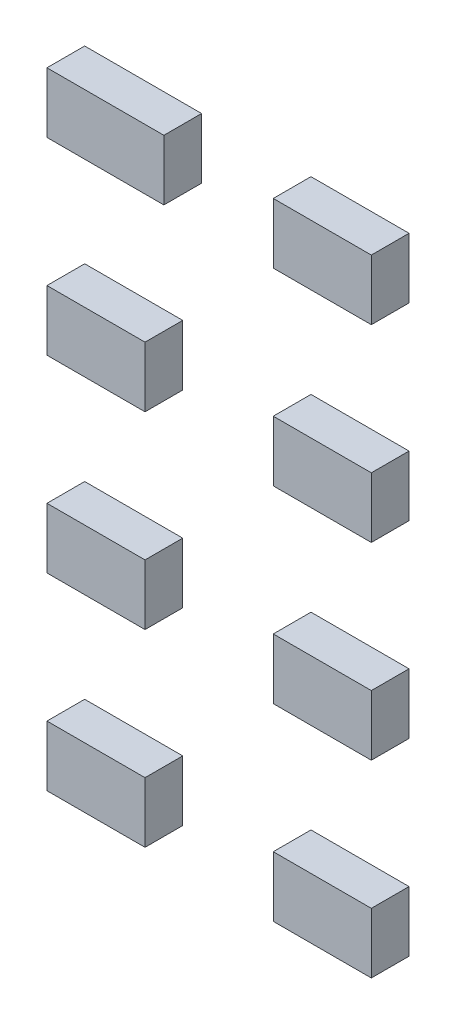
ISO-10303-21;
HEADER;
FILE_DESCRIPTION(('STEP AP214'),'2;1');
FILE_NAME('part.step','',(''),(''),'','','');
FILE_SCHEMA(('AUTOMOTIVE_DESIGN { 1 0 10303 214 1 1 1 1 }'));
ENDSEC;
DATA;
#1=APPLICATION_CONTEXT('core data for automotive mechanical design processes');
#2=APPLICATION_PROTOCOL_DEFINITION('international standard','automotive_design',2000,#1);
#3=PRODUCT_CONTEXT('',#1,'mechanical');
#4=PRODUCT('Part','Part','',(#3));
#5=PRODUCT_RELATED_PRODUCT_CATEGORY('part','',(#4));
#6=PRODUCT_DEFINITION_FORMATION('','',#4);
#7=PRODUCT_DEFINITION_CONTEXT('part definition',#1,'design');
#8=PRODUCT_DEFINITION('design','',#6,#7);
#9=PRODUCT_DEFINITION_SHAPE('','',#8);
#10=(LENGTH_UNIT() NAMED_UNIT(*) SI_UNIT(.MILLI.,.METRE.));
#11=(NAMED_UNIT(*) PLANE_ANGLE_UNIT() SI_UNIT($,.RADIAN.));
#12=(NAMED_UNIT(*) SI_UNIT($,.STERADIAN.) SOLID_ANGLE_UNIT());
#13=UNCERTAINTY_MEASURE_WITH_UNIT(LENGTH_MEASURE(1.E-05),#10,'distance_accuracy_value','');
#14=(GEOMETRIC_REPRESENTATION_CONTEXT(3) GLOBAL_UNCERTAINTY_ASSIGNED_CONTEXT((#13)) GLOBAL_UNIT_ASSIGNED_CONTEXT((#10,
#11,#12)) REPRESENTATION_CONTEXT('',''));
#15=CARTESIAN_POINT('',(0.,0.,0.));
#16=DIRECTION('',(0.,0.,1.));
#17=DIRECTION('',(1.,0.,0.));
#18=AXIS2_PLACEMENT_3D('',#15,#16,#17);
#19=CARTESIAN_POINT('',(-0.43,0.67,0.1));
#20=DIRECTION('',(0.,0.,1.));
#21=DIRECTION('',(1.,0.,0.));
#22=AXIS2_PLACEMENT_3D('',#19,#20,#21);
#23=PLANE('',#22);
#24=DIRECTION('',(0.,1.,0.));
#25=VECTOR('',#24,1.);
#26=CARTESIAN_POINT('',(-0.43,0.67,0.1));
#27=LINE('',#26,#25);
#28=CARTESIAN_POINT('',(-0.43,0.67,0.1));
#29=VERTEX_POINT('',#28);
#30=CARTESIAN_POINT('',(-0.43,0.83,0.1));
#31=VERTEX_POINT('',#30);
#32=EDGE_CURVE('P0_E108',#29,#31,#27,.T.);
#33=ORIENTED_EDGE('',*,*,#32,.F.);
#34=DIRECTION('',(1.,0.,0.));
#35=VECTOR('',#34,1.);
#36=CARTESIAN_POINT('',(-0.43,0.67,0.1));
#37=LINE('',#36,#35);
#38=CARTESIAN_POINT('',(-0.12,0.67,0.1));
#39=VERTEX_POINT('',#38);
#40=EDGE_CURVE('P0_E75',#29,#39,#37,.T.);
#41=ORIENTED_EDGE('',*,*,#40,.T.);
#42=DIRECTION('',(0.,1.,0.));
#43=VECTOR('',#42,1.);
#44=CARTESIAN_POINT('',(-0.12,0.67,0.1));
#45=LINE('',#44,#43);
#46=CARTESIAN_POINT('',(-0.12,0.83,0.1));
#47=VERTEX_POINT('',#46);
#48=EDGE_CURVE('P0_E87',#39,#47,#45,.T.);
#49=ORIENTED_EDGE('',*,*,#48,.T.);
#50=DIRECTION('',(1.,0.,0.));
#51=VECTOR('',#50,1.);
#52=CARTESIAN_POINT('',(-0.43,0.83,0.1));
#53=LINE('',#52,#51);
#54=EDGE_CURVE('P0_E11',#31,#47,#53,.T.);
#55=ORIENTED_EDGE('',*,*,#54,.F.);
#56=EDGE_LOOP('',(#33,#41,#49,#55));
#57=FACE_BOUND('',#56,.T.);
#58=ADVANCED_FACE('P0_F17',(#57),#23,.T.);
#59=CARTESIAN_POINT('',(-0.43,0.67,0.));
#60=DIRECTION('',(0.,0.,1.));
#61=DIRECTION('',(1.,0.,0.));
#62=AXIS2_PLACEMENT_3D('',#59,#60,#61);
#63=PLANE('',#62);
#64=DIRECTION('',(1.,0.,0.));
#65=VECTOR('',#64,1.);
#66=CARTESIAN_POINT('',(-0.43,0.83,0.));
#67=LINE('',#66,#65);
#68=CARTESIAN_POINT('',(-0.43,0.83,0.));
#69=VERTEX_POINT('',#68);
#70=CARTESIAN_POINT('',(-0.12,0.83,0.));
#71=VERTEX_POINT('',#70);
#72=EDGE_CURVE('P0_E25',#69,#71,#67,.T.);
#73=ORIENTED_EDGE('',*,*,#72,.T.);
#74=DIRECTION('',(0.,1.,0.));
#75=VECTOR('',#74,1.);
#76=CARTESIAN_POINT('',(-0.12,0.67,0.));
#77=LINE('',#76,#75);
#78=CARTESIAN_POINT('',(-0.12,0.67,0.));
#79=VERTEX_POINT('',#78);
#80=EDGE_CURVE('P0_E78',#79,#71,#77,.T.);
#81=ORIENTED_EDGE('',*,*,#80,.F.);
#82=DIRECTION('',(1.,0.,0.));
#83=VECTOR('',#82,1.);
#84=CARTESIAN_POINT('',(-0.43,0.67,0.));
#85=LINE('',#84,#83);
#86=CARTESIAN_POINT('',(-0.43,0.67,0.));
#87=VERTEX_POINT('',#86);
#88=EDGE_CURVE('P0_E66',#87,#79,#85,.T.);
#89=ORIENTED_EDGE('',*,*,#88,.F.);
#90=DIRECTION('',(0.,1.,0.));
#91=VECTOR('',#90,1.);
#92=CARTESIAN_POINT('',(-0.43,0.67,0.));
#93=LINE('',#92,#91);
#94=EDGE_CURVE('P0_E94',#87,#69,#93,.T.);
#95=ORIENTED_EDGE('',*,*,#94,.T.);
#96=EDGE_LOOP('',(#73,#81,#89,#95));
#97=FACE_BOUND('',#96,.T.);
#98=ADVANCED_FACE('P0_F79',(#97),#63,.F.);
#99=CARTESIAN_POINT('',(-0.43,0.83,0.));
#100=DIRECTION('',(0.,1.,0.));
#101=DIRECTION('',(1.,0.,0.));
#102=AXIS2_PLACEMENT_3D('',#99,#100,#101);
#103=PLANE('',#102);
#104=ORIENTED_EDGE('',*,*,#72,.F.);
#105=DIRECTION('',(0.,0.,1.));
#106=VECTOR('',#105,1.);
#107=CARTESIAN_POINT('',(-0.43,0.83,0.));
#108=LINE('',#107,#106);
#109=EDGE_CURVE('P0_E113',#69,#31,#108,.T.);
#110=ORIENTED_EDGE('',*,*,#109,.T.);
#111=ORIENTED_EDGE('',*,*,#54,.T.);
#112=DIRECTION('',(0.,0.,1.));
#113=VECTOR('',#112,1.);
#114=CARTESIAN_POINT('',(-0.12,0.83,0.));
#115=LINE('',#114,#113);
#116=EDGE_CURVE('P0_E83',#71,#47,#115,.T.);
#117=ORIENTED_EDGE('',*,*,#116,.F.);
#118=EDGE_LOOP('',(#104,#110,#111,#117));
#119=FACE_BOUND('',#118,.T.);
#120=ADVANCED_FACE('P0_F125',(#119),#103,.T.);
#121=CARTESIAN_POINT('',(-0.43,0.67,0.));
#122=DIRECTION('',(0.,1.,0.));
#123=DIRECTION('',(1.,0.,0.));
#124=AXIS2_PLACEMENT_3D('',#121,#122,#123);
#125=PLANE('',#124);
#126=DIRECTION('',(0.,0.,1.));
#127=VECTOR('',#126,1.);
#128=CARTESIAN_POINT('',(-0.12,0.67,0.));
#129=LINE('',#128,#127);
#130=EDGE_CURVE('P0_E70',#79,#39,#129,.T.);
#131=ORIENTED_EDGE('',*,*,#130,.T.);
#132=ORIENTED_EDGE('',*,*,#40,.F.);
#133=DIRECTION('',(0.,0.,1.));
#134=VECTOR('',#133,1.);
#135=CARTESIAN_POINT('',(-0.43,0.67,0.));
#136=LINE('',#135,#134);
#137=EDGE_CURVE('P0_E72',#87,#29,#136,.T.);
#138=ORIENTED_EDGE('',*,*,#137,.F.);
#139=ORIENTED_EDGE('',*,*,#88,.T.);
#140=EDGE_LOOP('',(#131,#132,#138,#139));
#141=FACE_BOUND('',#140,.T.);
#142=ADVANCED_FACE('P0_F67',(#141),#125,.F.);
#143=CARTESIAN_POINT('',(-0.12,0.67,0.));
#144=DIRECTION('',(1.,0.,0.));
#145=DIRECTION('',(0.,1.,0.));
#146=AXIS2_PLACEMENT_3D('',#143,#144,#145);
#147=PLANE('',#146);
#148=ORIENTED_EDGE('',*,*,#130,.F.);
#149=ORIENTED_EDGE('',*,*,#80,.T.);
#150=ORIENTED_EDGE('',*,*,#116,.T.);
#151=ORIENTED_EDGE('',*,*,#48,.F.);
#152=EDGE_LOOP('',(#148,#149,#150,#151));
#153=FACE_BOUND('',#152,.T.);
#154=ADVANCED_FACE('P0_F86',(#153),#147,.T.);
#155=CARTESIAN_POINT('',(-0.43,0.67,0.));
#156=DIRECTION('',(1.,0.,0.));
#157=DIRECTION('',(0.,1.,0.));
#158=AXIS2_PLACEMENT_3D('',#155,#156,#157);
#159=PLANE('',#158);
#160=ORIENTED_EDGE('',*,*,#32,.T.);
#161=ORIENTED_EDGE('',*,*,#109,.F.);
#162=ORIENTED_EDGE('',*,*,#94,.F.);
#163=ORIENTED_EDGE('',*,*,#137,.T.);
#164=EDGE_LOOP('',(#160,#161,#162,#163));
#165=FACE_BOUND('',#164,.T.);
#166=ADVANCED_FACE('P0_F111',(#165),#159,.F.);
#167=CLOSED_SHELL('',(#58,#98,#120,#142,#154,#166));
#168=MANIFOLD_SOLID_BREP('P0_B1',#167);
#169=CARTESIAN_POINT('',(-0.43,0.17,0.1));
#170=DIRECTION('',(0.,0.,1.));
#171=DIRECTION('',(1.,0.,0.));
#172=AXIS2_PLACEMENT_3D('',#169,#170,#171);
#173=PLANE('',#172);
#174=DIRECTION('',(0.,1.,0.));
#175=VECTOR('',#174,1.);
#176=CARTESIAN_POINT('',(-0.43,0.17,0.1));
#177=LINE('',#176,#175);
#178=CARTESIAN_POINT('',(-0.43,0.17,0.1));
#179=VERTEX_POINT('',#178);
#180=CARTESIAN_POINT('',(-0.43,0.33,0.1));
#181=VERTEX_POINT('',#180);
#182=EDGE_CURVE('P1_E88',#179,#181,#177,.T.);
#183=ORIENTED_EDGE('',*,*,#182,.F.);
#184=DIRECTION('',(1.,0.,0.));
#185=VECTOR('',#184,1.);
#186=CARTESIAN_POINT('',(-0.43,0.17,0.1));
#187=LINE('',#186,#185);
#188=CARTESIAN_POINT('',(-0.17,0.17,0.1));
#189=VERTEX_POINT('',#188);
#190=EDGE_CURVE('P1_E72',#179,#189,#187,.T.);
#191=ORIENTED_EDGE('',*,*,#190,.T.);
#192=DIRECTION('',(0.,1.,0.));
#193=VECTOR('',#192,1.);
#194=CARTESIAN_POINT('',(-0.17,0.17,0.1));
#195=LINE('',#194,#193);
#196=CARTESIAN_POINT('',(-0.17,0.33,0.1));
#197=VERTEX_POINT('',#196);
#198=EDGE_CURVE('P1_E83',#189,#197,#195,.T.);
#199=ORIENTED_EDGE('',*,*,#198,.T.);
#200=DIRECTION('',(1.,0.,0.));
#201=VECTOR('',#200,1.);
#202=CARTESIAN_POINT('',(-0.43,0.33,0.1));
#203=LINE('',#202,#201);
#204=EDGE_CURVE('P1_E11',#181,#197,#203,.T.);
#205=ORIENTED_EDGE('',*,*,#204,.F.);
#206=EDGE_LOOP('',(#183,#191,#199,#205));
#207=FACE_BOUND('',#206,.T.);
#208=ADVANCED_FACE('P1_F17',(#207),#173,.T.);
#209=CARTESIAN_POINT('',(-0.43,0.17,0.));
#210=DIRECTION('',(0.,0.,1.));
#211=DIRECTION('',(1.,0.,0.));
#212=AXIS2_PLACEMENT_3D('',#209,#210,#211);
#213=PLANE('',#212);
#214=DIRECTION('',(1.,0.,0.));
#215=VECTOR('',#214,1.);
#216=CARTESIAN_POINT('',(-0.43,0.33,0.));
#217=LINE('',#216,#215);
#218=CARTESIAN_POINT('',(-0.43,0.33,0.));
#219=VERTEX_POINT('',#218);
#220=CARTESIAN_POINT('',(-0.17,0.33,0.));
#221=VERTEX_POINT('',#220);
#222=EDGE_CURVE('P1_E26',#219,#221,#217,.T.);
#223=ORIENTED_EDGE('',*,*,#222,.T.);
#224=DIRECTION('',(0.,1.,0.));
#225=VECTOR('',#224,1.);
#226=CARTESIAN_POINT('',(-0.17,0.17,0.));
#227=LINE('',#226,#225);
#228=CARTESIAN_POINT('',(-0.17,0.17,0.));
#229=VERTEX_POINT('',#228);
#230=EDGE_CURVE('P1_E107',#229,#221,#227,.T.);
#231=ORIENTED_EDGE('',*,*,#230,.F.);
#232=DIRECTION('',(1.,0.,0.));
#233=VECTOR('',#232,1.);
#234=CARTESIAN_POINT('',(-0.43,0.17,0.));
#235=LINE('',#234,#233);
#236=CARTESIAN_POINT('',(-0.43,0.17,0.));
#237=VERTEX_POINT('',#236);
#238=EDGE_CURVE('P1_E20',#237,#229,#235,.T.);
#239=ORIENTED_EDGE('',*,*,#238,.F.);
#240=DIRECTION('',(0.,1.,0.));
#241=VECTOR('',#240,1.);
#242=CARTESIAN_POINT('',(-0.43,0.17,0.));
#243=LINE('',#242,#241);
#244=EDGE_CURVE('P1_E89',#237,#219,#243,.T.);
#245=ORIENTED_EDGE('',*,*,#244,.T.);
#246=EDGE_LOOP('',(#223,#231,#239,#245));
#247=FACE_BOUND('',#246,.T.);
#248=ADVANCED_FACE('P1_F121',(#247),#213,.F.);
#249=CARTESIAN_POINT('',(-0.43,0.33,0.));
#250=DIRECTION('',(0.,1.,0.));
#251=DIRECTION('',(1.,0.,0.));
#252=AXIS2_PLACEMENT_3D('',#249,#250,#251);
#253=PLANE('',#252);
#254=ORIENTED_EDGE('',*,*,#222,.F.);
#255=DIRECTION('',(0.,0.,1.));
#256=VECTOR('',#255,1.);
#257=CARTESIAN_POINT('',(-0.43,0.33,0.));
#258=LINE('',#257,#256);
#259=EDGE_CURVE('P1_E93',#219,#181,#258,.T.);
#260=ORIENTED_EDGE('',*,*,#259,.T.);
#261=ORIENTED_EDGE('',*,*,#204,.T.);
#262=DIRECTION('',(0.,0.,1.));
#263=VECTOR('',#262,1.);
#264=CARTESIAN_POINT('',(-0.17,0.33,0.));
#265=LINE('',#264,#263);
#266=EDGE_CURVE('P1_E111',#221,#197,#265,.T.);
#267=ORIENTED_EDGE('',*,*,#266,.F.);
#268=EDGE_LOOP('',(#254,#260,#261,#267));
#269=FACE_BOUND('',#268,.T.);
#270=ADVANCED_FACE('P1_F120',(#269),#253,.T.);
#271=CARTESIAN_POINT('',(-0.43,0.17,0.));
#272=DIRECTION('',(0.,1.,0.));
#273=DIRECTION('',(1.,0.,0.));
#274=AXIS2_PLACEMENT_3D('',#271,#272,#273);
#275=PLANE('',#274);
#276=DIRECTION('',(0.,0.,1.));
#277=VECTOR('',#276,1.);
#278=CARTESIAN_POINT('',(-0.17,0.17,0.));
#279=LINE('',#278,#277);
#280=EDGE_CURVE('P1_E78',#229,#189,#279,.T.);
#281=ORIENTED_EDGE('',*,*,#280,.T.);
#282=ORIENTED_EDGE('',*,*,#190,.F.);
#283=DIRECTION('',(0.,0.,1.));
#284=VECTOR('',#283,1.);
#285=CARTESIAN_POINT('',(-0.43,0.17,0.));
#286=LINE('',#285,#284);
#287=EDGE_CURVE('P1_E75',#237,#179,#286,.T.);
#288=ORIENTED_EDGE('',*,*,#287,.F.);
#289=ORIENTED_EDGE('',*,*,#238,.T.);
#290=EDGE_LOOP('',(#281,#282,#288,#289));
#291=FACE_BOUND('',#290,.T.);
#292=ADVANCED_FACE('P1_F74',(#291),#275,.F.);
#293=CARTESIAN_POINT('',(-0.17,0.17,0.));
#294=DIRECTION('',(1.,0.,0.));
#295=DIRECTION('',(0.,1.,0.));
#296=AXIS2_PLACEMENT_3D('',#293,#294,#295);
#297=PLANE('',#296);
#298=ORIENTED_EDGE('',*,*,#280,.F.);
#299=ORIENTED_EDGE('',*,*,#230,.T.);
#300=ORIENTED_EDGE('',*,*,#266,.T.);
#301=ORIENTED_EDGE('',*,*,#198,.F.);
#302=EDGE_LOOP('',(#298,#299,#300,#301));
#303=FACE_BOUND('',#302,.T.);
#304=ADVANCED_FACE('P1_F119',(#303),#297,.T.);
#305=CARTESIAN_POINT('',(-0.43,0.17,0.));
#306=DIRECTION('',(1.,0.,0.));
#307=DIRECTION('',(0.,1.,0.));
#308=AXIS2_PLACEMENT_3D('',#305,#306,#307);
#309=PLANE('',#308);
#310=ORIENTED_EDGE('',*,*,#182,.T.);
#311=ORIENTED_EDGE('',*,*,#259,.F.);
#312=ORIENTED_EDGE('',*,*,#244,.F.);
#313=ORIENTED_EDGE('',*,*,#287,.T.);
#314=EDGE_LOOP('',(#310,#311,#312,#313));
#315=FACE_BOUND('',#314,.T.);
#316=ADVANCED_FACE('P1_F86',(#315),#309,.F.);
#317=CLOSED_SHELL('',(#208,#248,#270,#292,#304,#316));
#318=MANIFOLD_SOLID_BREP('P1_B1',#317);
#319=CARTESIAN_POINT('',(-0.43,-0.33,0.1));
#320=DIRECTION('',(0.,0.,1.));
#321=DIRECTION('',(1.,0.,0.));
#322=AXIS2_PLACEMENT_3D('',#319,#320,#321);
#323=PLANE('',#322);
#324=DIRECTION('',(0.,1.,0.));
#325=VECTOR('',#324,1.);
#326=CARTESIAN_POINT('',(-0.43,-0.33,0.1));
#327=LINE('',#326,#325);
#328=CARTESIAN_POINT('',(-0.43,-0.33,0.1));
#329=VERTEX_POINT('',#328);
#330=CARTESIAN_POINT('',(-0.43,-0.17,0.1));
#331=VERTEX_POINT('',#330);
#332=EDGE_CURVE('P2_E88',#329,#331,#327,.T.);
#333=ORIENTED_EDGE('',*,*,#332,.F.);
#334=DIRECTION('',(1.,0.,0.));
#335=VECTOR('',#334,1.);
#336=CARTESIAN_POINT('',(-0.43,-0.33,0.1));
#337=LINE('',#336,#335);
#338=CARTESIAN_POINT('',(-0.17,-0.33,0.1));
#339=VERTEX_POINT('',#338);
#340=EDGE_CURVE('P2_E70',#329,#339,#337,.T.);
#341=ORIENTED_EDGE('',*,*,#340,.T.);
#342=DIRECTION('',(0.,1.,0.));
#343=VECTOR('',#342,1.);
#344=CARTESIAN_POINT('',(-0.17,-0.33,0.1));
#345=LINE('',#344,#343);
#346=CARTESIAN_POINT('',(-0.17,-0.17,0.1));
#347=VERTEX_POINT('',#346);
#348=EDGE_CURVE('P2_E82',#339,#347,#345,.T.);
#349=ORIENTED_EDGE('',*,*,#348,.T.);
#350=DIRECTION('',(1.,0.,0.));
#351=VECTOR('',#350,1.);
#352=CARTESIAN_POINT('',(-0.43,-0.17,0.1));
#353=LINE('',#352,#351);
#354=EDGE_CURVE('P2_E11',#331,#347,#353,.T.);
#355=ORIENTED_EDGE('',*,*,#354,.F.);
#356=EDGE_LOOP('',(#333,#341,#349,#355));
#357=FACE_BOUND('',#356,.T.);
#358=ADVANCED_FACE('P2_F17',(#357),#323,.T.);
#359=CARTESIAN_POINT('',(-0.43,-0.33,0.));
#360=DIRECTION('',(0.,0.,1.));
#361=DIRECTION('',(1.,0.,0.));
#362=AXIS2_PLACEMENT_3D('',#359,#360,#361);
#363=PLANE('',#362);
#364=DIRECTION('',(1.,0.,0.));
#365=VECTOR('',#364,1.);
#366=CARTESIAN_POINT('',(-0.43,-0.17,0.));
#367=LINE('',#366,#365);
#368=CARTESIAN_POINT('',(-0.43,-0.17,0.));
#369=VERTEX_POINT('',#368);
#370=CARTESIAN_POINT('',(-0.17,-0.17,0.));
#371=VERTEX_POINT('',#370);
#372=EDGE_CURVE('P2_E25',#369,#371,#367,.T.);
#373=ORIENTED_EDGE('',*,*,#372,.T.);
#374=DIRECTION('',(0.,1.,0.));
#375=VECTOR('',#374,1.);
#376=CARTESIAN_POINT('',(-0.17,-0.33,0.));
#377=LINE('',#376,#375);
#378=CARTESIAN_POINT('',(-0.17,-0.33,0.));
#379=VERTEX_POINT('',#378);
#380=EDGE_CURVE('P2_E101',#379,#371,#377,.T.);
#381=ORIENTED_EDGE('',*,*,#380,.F.);
#382=DIRECTION('',(1.,0.,0.));
#383=VECTOR('',#382,1.);
#384=CARTESIAN_POINT('',(-0.43,-0.33,0.));
#385=LINE('',#384,#383);
#386=CARTESIAN_POINT('',(-0.43,-0.33,0.));
#387=VERTEX_POINT('',#386);
#388=EDGE_CURVE('P2_E81',#387,#379,#385,.T.);
#389=ORIENTED_EDGE('',*,*,#388,.F.);
#390=DIRECTION('',(0.,1.,0.));
#391=VECTOR('',#390,1.);
#392=CARTESIAN_POINT('',(-0.43,-0.33,0.));
#393=LINE('',#392,#391);
#394=EDGE_CURVE('P2_E89',#387,#369,#393,.T.);
#395=ORIENTED_EDGE('',*,*,#394,.T.);
#396=EDGE_LOOP('',(#373,#381,#389,#395));
#397=FACE_BOUND('',#396,.T.);
#398=ADVANCED_FACE('P2_F156',(#397),#363,.F.);
#399=CARTESIAN_POINT('',(-0.43,-0.17,0.));
#400=DIRECTION('',(0.,1.,0.));
#401=DIRECTION('',(1.,0.,0.));
#402=AXIS2_PLACEMENT_3D('',#399,#400,#401);
#403=PLANE('',#402);
#404=ORIENTED_EDGE('',*,*,#372,.F.);
#405=DIRECTION('',(0.,0.,1.));
#406=VECTOR('',#405,1.);
#407=CARTESIAN_POINT('',(-0.43,-0.17,0.));
#408=LINE('',#407,#406);
#409=EDGE_CURVE('P2_E93',#369,#331,#408,.T.);
#410=ORIENTED_EDGE('',*,*,#409,.T.);
#411=ORIENTED_EDGE('',*,*,#354,.T.);
#412=DIRECTION('',(0.,0.,1.));
#413=VECTOR('',#412,1.);
#414=CARTESIAN_POINT('',(-0.17,-0.17,0.));
#415=LINE('',#414,#413);
#416=EDGE_CURVE('P2_E105',#371,#347,#415,.T.);
#417=ORIENTED_EDGE('',*,*,#416,.F.);
#418=EDGE_LOOP('',(#404,#410,#411,#417));
#419=FACE_BOUND('',#418,.T.);
#420=ADVANCED_FACE('P2_F157',(#419),#403,.T.);
#421=CARTESIAN_POINT('',(-0.43,-0.33,0.));
#422=DIRECTION('',(0.,1.,0.));
#423=DIRECTION('',(1.,0.,0.));
#424=AXIS2_PLACEMENT_3D('',#421,#422,#423);
#425=PLANE('',#424);
#426=DIRECTION('',(0.,0.,1.));
#427=VECTOR('',#426,1.);
#428=CARTESIAN_POINT('',(-0.17,-0.33,0.));
#429=LINE('',#428,#427);
#430=EDGE_CURVE('P2_E76',#379,#339,#429,.T.);
#431=ORIENTED_EDGE('',*,*,#430,.T.);
#432=ORIENTED_EDGE('',*,*,#340,.F.);
#433=DIRECTION('',(0.,0.,1.));
#434=VECTOR('',#433,1.);
#435=CARTESIAN_POINT('',(-0.43,-0.33,0.));
#436=LINE('',#435,#434);
#437=EDGE_CURVE('P2_E73',#387,#329,#436,.T.);
#438=ORIENTED_EDGE('',*,*,#437,.F.);
#439=ORIENTED_EDGE('',*,*,#388,.T.);
#440=EDGE_LOOP('',(#431,#432,#438,#439));
#441=FACE_BOUND('',#440,.T.);
#442=ADVANCED_FACE('P2_F72',(#441),#425,.F.);
#443=CARTESIAN_POINT('',(-0.17,-0.33,0.));
#444=DIRECTION('',(1.,0.,0.));
#445=DIRECTION('',(0.,1.,0.));
#446=AXIS2_PLACEMENT_3D('',#443,#444,#445);
#447=PLANE('',#446);
#448=ORIENTED_EDGE('',*,*,#430,.F.);
#449=ORIENTED_EDGE('',*,*,#380,.T.);
#450=ORIENTED_EDGE('',*,*,#416,.T.);
#451=ORIENTED_EDGE('',*,*,#348,.F.);
#452=EDGE_LOOP('',(#448,#449,#450,#451));
#453=FACE_BOUND('',#452,.T.);
#454=ADVANCED_FACE('P2_F155',(#453),#447,.T.);
#455=CARTESIAN_POINT('',(-0.43,-0.33,0.));
#456=DIRECTION('',(1.,0.,0.));
#457=DIRECTION('',(0.,1.,0.));
#458=AXIS2_PLACEMENT_3D('',#455,#456,#457);
#459=PLANE('',#458);
#460=ORIENTED_EDGE('',*,*,#332,.T.);
#461=ORIENTED_EDGE('',*,*,#409,.F.);
#462=ORIENTED_EDGE('',*,*,#394,.F.);
#463=ORIENTED_EDGE('',*,*,#437,.T.);
#464=EDGE_LOOP('',(#460,#461,#462,#463));
#465=FACE_BOUND('',#464,.T.);
#466=ADVANCED_FACE('P2_F86',(#465),#459,.F.);
#467=CLOSED_SHELL('',(#358,#398,#420,#442,#454,#466));
#468=MANIFOLD_SOLID_BREP('P2_B1',#467);
#469=CARTESIAN_POINT('',(-0.43,-0.83,0.1));
#470=DIRECTION('',(0.,0.,1.));
#471=DIRECTION('',(1.,0.,0.));
#472=AXIS2_PLACEMENT_3D('',#469,#470,#471);
#473=PLANE('',#472);
#474=DIRECTION('',(0.,1.,0.));
#475=VECTOR('',#474,1.);
#476=CARTESIAN_POINT('',(-0.43,-0.83,0.1));
#477=LINE('',#476,#475);
#478=CARTESIAN_POINT('',(-0.43,-0.83,0.1));
#479=VERTEX_POINT('',#478);
#480=CARTESIAN_POINT('',(-0.43,-0.67,0.1));
#481=VERTEX_POINT('',#480);
#482=EDGE_CURVE('P3_E88',#479,#481,#477,.T.);
#483=ORIENTED_EDGE('',*,*,#482,.F.);
#484=DIRECTION('',(1.,0.,0.));
#485=VECTOR('',#484,1.);
#486=CARTESIAN_POINT('',(-0.43,-0.83,0.1));
#487=LINE('',#486,#485);
#488=CARTESIAN_POINT('',(-0.17,-0.83,0.1));
#489=VERTEX_POINT('',#488);
#490=EDGE_CURVE('P3_E70',#479,#489,#487,.T.);
#491=ORIENTED_EDGE('',*,*,#490,.T.);
#492=DIRECTION('',(0.,1.,0.));
#493=VECTOR('',#492,1.);
#494=CARTESIAN_POINT('',(-0.17,-0.83,0.1));
#495=LINE('',#494,#493);
#496=CARTESIAN_POINT('',(-0.17,-0.67,0.1));
#497=VERTEX_POINT('',#496);
#498=EDGE_CURVE('P3_E82',#489,#497,#495,.T.);
#499=ORIENTED_EDGE('',*,*,#498,.T.);
#500=DIRECTION('',(1.,0.,0.));
#501=VECTOR('',#500,1.);
#502=CARTESIAN_POINT('',(-0.43,-0.67,0.1));
#503=LINE('',#502,#501);
#504=EDGE_CURVE('P3_E11',#481,#497,#503,.T.);
#505=ORIENTED_EDGE('',*,*,#504,.F.);
#506=EDGE_LOOP('',(#483,#491,#499,#505));
#507=FACE_BOUND('',#506,.T.);
#508=ADVANCED_FACE('P3_F17',(#507),#473,.T.);
#509=CARTESIAN_POINT('',(-0.43,-0.83,0.));
#510=DIRECTION('',(0.,0.,1.));
#511=DIRECTION('',(1.,0.,0.));
#512=AXIS2_PLACEMENT_3D('',#509,#510,#511);
#513=PLANE('',#512);
#514=DIRECTION('',(1.,0.,0.));
#515=VECTOR('',#514,1.);
#516=CARTESIAN_POINT('',(-0.43,-0.67,0.));
#517=LINE('',#516,#515);
#518=CARTESIAN_POINT('',(-0.43,-0.67,0.));
#519=VERTEX_POINT('',#518);
#520=CARTESIAN_POINT('',(-0.17,-0.67,0.));
#521=VERTEX_POINT('',#520);
#522=EDGE_CURVE('P3_E25',#519,#521,#517,.T.);
#523=ORIENTED_EDGE('',*,*,#522,.T.);
#524=DIRECTION('',(0.,1.,0.));
#525=VECTOR('',#524,1.);
#526=CARTESIAN_POINT('',(-0.17,-0.83,0.));
#527=LINE('',#526,#525);
#528=CARTESIAN_POINT('',(-0.17,-0.83,0.));
#529=VERTEX_POINT('',#528);
#530=EDGE_CURVE('P3_E107',#529,#521,#527,.T.);
#531=ORIENTED_EDGE('',*,*,#530,.F.);
#532=DIRECTION('',(1.,0.,0.));
#533=VECTOR('',#532,1.);
#534=CARTESIAN_POINT('',(-0.43,-0.83,0.));
#535=LINE('',#534,#533);
#536=CARTESIAN_POINT('',(-0.43,-0.83,0.));
#537=VERTEX_POINT('',#536);
#538=EDGE_CURVE('P3_E81',#537,#529,#535,.T.);
#539=ORIENTED_EDGE('',*,*,#538,.F.);
#540=DIRECTION('',(0.,1.,0.));
#541=VECTOR('',#540,1.);
#542=CARTESIAN_POINT('',(-0.43,-0.83,0.));
#543=LINE('',#542,#541);
#544=EDGE_CURVE('P3_E89',#537,#519,#543,.T.);
#545=ORIENTED_EDGE('',*,*,#544,.T.);
#546=EDGE_LOOP('',(#523,#531,#539,#545));
#547=FACE_BOUND('',#546,.T.);
#548=ADVANCED_FACE('P3_F119',(#547),#513,.F.);
#549=CARTESIAN_POINT('',(-0.43,-0.67,0.));
#550=DIRECTION('',(0.,1.,0.));
#551=DIRECTION('',(1.,0.,0.));
#552=AXIS2_PLACEMENT_3D('',#549,#550,#551);
#553=PLANE('',#552);
#554=ORIENTED_EDGE('',*,*,#522,.F.);
#555=DIRECTION('',(0.,0.,1.));
#556=VECTOR('',#555,1.);
#557=CARTESIAN_POINT('',(-0.43,-0.67,0.));
#558=LINE('',#557,#556);
#559=EDGE_CURVE('P3_E93',#519,#481,#558,.T.);
#560=ORIENTED_EDGE('',*,*,#559,.T.);
#561=ORIENTED_EDGE('',*,*,#504,.T.);
#562=DIRECTION('',(0.,0.,1.));
#563=VECTOR('',#562,1.);
#564=CARTESIAN_POINT('',(-0.17,-0.67,0.));
#565=LINE('',#564,#563);
#566=EDGE_CURVE('P3_E111',#521,#497,#565,.T.);
#567=ORIENTED_EDGE('',*,*,#566,.F.);
#568=EDGE_LOOP('',(#554,#560,#561,#567));
#569=FACE_BOUND('',#568,.T.);
#570=ADVANCED_FACE('P3_F122',(#569),#553,.T.);
#571=CARTESIAN_POINT('',(-0.43,-0.83,0.));
#572=DIRECTION('',(0.,1.,0.));
#573=DIRECTION('',(1.,0.,0.));
#574=AXIS2_PLACEMENT_3D('',#571,#572,#573);
#575=PLANE('',#574);
#576=DIRECTION('',(0.,0.,1.));
#577=VECTOR('',#576,1.);
#578=CARTESIAN_POINT('',(-0.17,-0.83,0.));
#579=LINE('',#578,#577);
#580=EDGE_CURVE('P3_E76',#529,#489,#579,.T.);
#581=ORIENTED_EDGE('',*,*,#580,.T.);
#582=ORIENTED_EDGE('',*,*,#490,.F.);
#583=DIRECTION('',(0.,0.,1.));
#584=VECTOR('',#583,1.);
#585=CARTESIAN_POINT('',(-0.43,-0.83,0.));
#586=LINE('',#585,#584);
#587=EDGE_CURVE('P3_E73',#537,#479,#586,.T.);
#588=ORIENTED_EDGE('',*,*,#587,.F.);
#589=ORIENTED_EDGE('',*,*,#538,.T.);
#590=EDGE_LOOP('',(#581,#582,#588,#589));
#591=FACE_BOUND('',#590,.T.);
#592=ADVANCED_FACE('P3_F72',(#591),#575,.F.);
#593=CARTESIAN_POINT('',(-0.17,-0.83,0.));
#594=DIRECTION('',(1.,0.,0.));
#595=DIRECTION('',(0.,1.,0.));
#596=AXIS2_PLACEMENT_3D('',#593,#594,#595);
#597=PLANE('',#596);
#598=ORIENTED_EDGE('',*,*,#580,.F.);
#599=ORIENTED_EDGE('',*,*,#530,.T.);
#600=ORIENTED_EDGE('',*,*,#566,.T.);
#601=ORIENTED_EDGE('',*,*,#498,.F.);
#602=EDGE_LOOP('',(#598,#599,#600,#601));
#603=FACE_BOUND('',#602,.T.);
#604=ADVANCED_FACE('P3_F121',(#603),#597,.T.);
#605=CARTESIAN_POINT('',(-0.43,-0.83,0.));
#606=DIRECTION('',(1.,0.,0.));
#607=DIRECTION('',(0.,1.,0.));
#608=AXIS2_PLACEMENT_3D('',#605,#606,#607);
#609=PLANE('',#608);
#610=ORIENTED_EDGE('',*,*,#482,.T.);
#611=ORIENTED_EDGE('',*,*,#559,.F.);
#612=ORIENTED_EDGE('',*,*,#544,.F.);
#613=ORIENTED_EDGE('',*,*,#587,.T.);
#614=EDGE_LOOP('',(#610,#611,#612,#613));
#615=FACE_BOUND('',#614,.T.);
#616=ADVANCED_FACE('P3_F86',(#615),#609,.F.);
#617=CLOSED_SHELL('',(#508,#548,#570,#592,#604,#616));
#618=MANIFOLD_SOLID_BREP('P3_B1',#617);
#619=CARTESIAN_POINT('',(0.17,-0.83,0.1));
#620=DIRECTION('',(0.,0.,1.));
#621=DIRECTION('',(1.,0.,0.));
#622=AXIS2_PLACEMENT_3D('',#619,#620,#621);
#623=PLANE('',#622);
#624=DIRECTION('',(0.,1.,0.));
#625=VECTOR('',#624,1.);
#626=CARTESIAN_POINT('',(0.17,-0.83,0.1));
#627=LINE('',#626,#625);
#628=CARTESIAN_POINT('',(0.17,-0.83,0.1));
#629=VERTEX_POINT('',#628);
#630=CARTESIAN_POINT('',(0.17,-0.67,0.1));
#631=VERTEX_POINT('',#630);
#632=EDGE_CURVE('P4_E67',#629,#631,#627,.T.);
#633=ORIENTED_EDGE('',*,*,#632,.F.);
#634=DIRECTION('',(1.,0.,0.));
#635=VECTOR('',#634,1.);
#636=CARTESIAN_POINT('',(0.17,-0.83,0.1));
#637=LINE('',#636,#635);
#638=CARTESIAN_POINT('',(0.43,-0.83,0.1));
#639=VERTEX_POINT('',#638);
#640=EDGE_CURVE('P4_E62',#629,#639,#637,.T.);
#641=ORIENTED_EDGE('',*,*,#640,.T.);
#642=DIRECTION('',(0.,1.,0.));
#643=VECTOR('',#642,1.);
#644=CARTESIAN_POINT('',(0.43,-0.83,0.1));
#645=LINE('',#644,#643);
#646=CARTESIAN_POINT('',(0.43,-0.67,0.1));
#647=VERTEX_POINT('',#646);
#648=EDGE_CURVE('P4_E64',#639,#647,#645,.T.);
#649=ORIENTED_EDGE('',*,*,#648,.T.);
#650=DIRECTION('',(1.,0.,0.));
#651=VECTOR('',#650,1.);
#652=CARTESIAN_POINT('',(0.17,-0.67,0.1));
#653=LINE('',#652,#651);
#654=EDGE_CURVE('P4_E11',#631,#647,#653,.T.);
#655=ORIENTED_EDGE('',*,*,#654,.F.);
#656=EDGE_LOOP('',(#633,#641,#649,#655));
#657=FACE_BOUND('',#656,.T.);
#658=ADVANCED_FACE('P4_F17',(#657),#623,.T.);
#659=CARTESIAN_POINT('',(0.17,-0.83,0.));
#660=DIRECTION('',(0.,0.,1.));
#661=DIRECTION('',(1.,0.,0.));
#662=AXIS2_PLACEMENT_3D('',#659,#660,#661);
#663=PLANE('',#662);
#664=DIRECTION('',(1.,0.,0.));
#665=VECTOR('',#664,1.);
#666=CARTESIAN_POINT('',(0.17,-0.67,0.));
#667=LINE('',#666,#665);
#668=CARTESIAN_POINT('',(0.17,-0.67,0.));
#669=VERTEX_POINT('',#668);
#670=CARTESIAN_POINT('',(0.43,-0.67,0.));
#671=VERTEX_POINT('',#670);
#672=EDGE_CURVE('P4_E26',#669,#671,#667,.T.);
#673=ORIENTED_EDGE('',*,*,#672,.T.);
#674=DIRECTION('',(0.,1.,0.));
#675=VECTOR('',#674,1.);
#676=CARTESIAN_POINT('',(0.43,-0.83,0.));
#677=LINE('',#676,#675);
#678=CARTESIAN_POINT('',(0.43,-0.83,0.));
#679=VERTEX_POINT('',#678);
#680=EDGE_CURVE('P4_E86',#679,#671,#677,.T.);
#681=ORIENTED_EDGE('',*,*,#680,.F.);
#682=DIRECTION('',(1.,0.,0.));
#683=VECTOR('',#682,1.);
#684=CARTESIAN_POINT('',(0.17,-0.83,0.));
#685=LINE('',#684,#683);
#686=CARTESIAN_POINT('',(0.17,-0.83,0.));
#687=VERTEX_POINT('',#686);
#688=EDGE_CURVE('P4_E73',#687,#679,#685,.T.);
#689=ORIENTED_EDGE('',*,*,#688,.F.);
#690=DIRECTION('',(0.,1.,0.));
#691=VECTOR('',#690,1.);
#692=CARTESIAN_POINT('',(0.17,-0.83,0.));
#693=LINE('',#692,#691);
#694=EDGE_CURVE('P4_E95',#687,#669,#693,.T.);
#695=ORIENTED_EDGE('',*,*,#694,.T.);
#696=EDGE_LOOP('',(#673,#681,#689,#695));
#697=FACE_BOUND('',#696,.T.);
#698=ADVANCED_FACE('P4_F107',(#697),#663,.F.);
#699=CARTESIAN_POINT('',(0.17,-0.67,0.));
#700=DIRECTION('',(0.,1.,0.));
#701=DIRECTION('',(1.,0.,0.));
#702=AXIS2_PLACEMENT_3D('',#699,#700,#701);
#703=PLANE('',#702);
#704=ORIENTED_EDGE('',*,*,#672,.F.);
#705=DIRECTION('',(0.,0.,1.));
#706=VECTOR('',#705,1.);
#707=CARTESIAN_POINT('',(0.17,-0.67,0.));
#708=LINE('',#707,#706);
#709=EDGE_CURVE('P4_E166',#669,#631,#708,.T.);
#710=ORIENTED_EDGE('',*,*,#709,.T.);
#711=ORIENTED_EDGE('',*,*,#654,.T.);
#712=DIRECTION('',(0.,0.,1.));
#713=VECTOR('',#712,1.);
#714=CARTESIAN_POINT('',(0.43,-0.67,0.));
#715=LINE('',#714,#713);
#716=EDGE_CURVE('P4_E80',#671,#647,#715,.T.);
#717=ORIENTED_EDGE('',*,*,#716,.F.);
#718=EDGE_LOOP('',(#704,#710,#711,#717));
#719=FACE_BOUND('',#718,.T.);
#720=ADVANCED_FACE('P4_F110',(#719),#703,.T.);
#721=CARTESIAN_POINT('',(0.17,-0.83,0.));
#722=DIRECTION('',(0.,1.,0.));
#723=DIRECTION('',(1.,0.,0.));
#724=AXIS2_PLACEMENT_3D('',#721,#722,#723);
#725=PLANE('',#724);
#726=DIRECTION('',(0.,0.,1.));
#727=VECTOR('',#726,1.);
#728=CARTESIAN_POINT('',(0.43,-0.83,0.));
#729=LINE('',#728,#727);
#730=EDGE_CURVE('P4_E79',#679,#639,#729,.T.);
#731=ORIENTED_EDGE('',*,*,#730,.T.);
#732=ORIENTED_EDGE('',*,*,#640,.F.);
#733=DIRECTION('',(0.,0.,1.));
#734=VECTOR('',#733,1.);
#735=CARTESIAN_POINT('',(0.17,-0.83,0.));
#736=LINE('',#735,#734);
#737=EDGE_CURVE('P4_E87',#687,#629,#736,.T.);
#738=ORIENTED_EDGE('',*,*,#737,.F.);
#739=ORIENTED_EDGE('',*,*,#688,.T.);
#740=EDGE_LOOP('',(#731,#732,#738,#739));
#741=FACE_BOUND('',#740,.T.);
#742=ADVANCED_FACE('P4_F83',(#741),#725,.F.);
#743=CARTESIAN_POINT('',(0.43,-0.83,0.));
#744=DIRECTION('',(1.,0.,0.));
#745=DIRECTION('',(0.,1.,0.));
#746=AXIS2_PLACEMENT_3D('',#743,#744,#745);
#747=PLANE('',#746);
#748=ORIENTED_EDGE('',*,*,#730,.F.);
#749=ORIENTED_EDGE('',*,*,#680,.T.);
#750=ORIENTED_EDGE('',*,*,#716,.T.);
#751=ORIENTED_EDGE('',*,*,#648,.F.);
#752=EDGE_LOOP('',(#748,#749,#750,#751));
#753=FACE_BOUND('',#752,.T.);
#754=ADVANCED_FACE('P4_F77',(#753),#747,.T.);
#755=CARTESIAN_POINT('',(0.17,-0.83,0.));
#756=DIRECTION('',(1.,0.,0.));
#757=DIRECTION('',(0.,1.,0.));
#758=AXIS2_PLACEMENT_3D('',#755,#756,#757);
#759=PLANE('',#758);
#760=ORIENTED_EDGE('',*,*,#632,.T.);
#761=ORIENTED_EDGE('',*,*,#709,.F.);
#762=ORIENTED_EDGE('',*,*,#694,.F.);
#763=ORIENTED_EDGE('',*,*,#737,.T.);
#764=EDGE_LOOP('',(#760,#761,#762,#763));
#765=FACE_BOUND('',#764,.T.);
#766=ADVANCED_FACE('P4_F170',(#765),#759,.F.);
#767=CLOSED_SHELL('',(#658,#698,#720,#742,#754,#766));
#768=MANIFOLD_SOLID_BREP('P4_B1',#767);
#769=CARTESIAN_POINT('',(0.17,-0.33,0.1));
#770=DIRECTION('',(0.,0.,1.));
#771=DIRECTION('',(1.,0.,0.));
#772=AXIS2_PLACEMENT_3D('',#769,#770,#771);
#773=PLANE('',#772);
#774=DIRECTION('',(0.,1.,0.));
#775=VECTOR('',#774,1.);
#776=CARTESIAN_POINT('',(0.17,-0.33,0.1));
#777=LINE('',#776,#775);
#778=CARTESIAN_POINT('',(0.17,-0.33,0.1));
#779=VERTEX_POINT('',#778);
#780=CARTESIAN_POINT('',(0.17,-0.17,0.1));
#781=VERTEX_POINT('',#780);
#782=EDGE_CURVE('P5_E89',#779,#781,#777,.T.);
#783=ORIENTED_EDGE('',*,*,#782,.F.);
#784=DIRECTION('',(1.,0.,0.));
#785=VECTOR('',#784,1.);
#786=CARTESIAN_POINT('',(0.17,-0.33,0.1));
#787=LINE('',#786,#785);
#788=CARTESIAN_POINT('',(0.43,-0.33,0.1));
#789=VERTEX_POINT('',#788);
#790=EDGE_CURVE('P5_E71',#779,#789,#787,.T.);
#791=ORIENTED_EDGE('',*,*,#790,.T.);
#792=DIRECTION('',(0.,1.,0.));
#793=VECTOR('',#792,1.);
#794=CARTESIAN_POINT('',(0.43,-0.33,0.1));
#795=LINE('',#794,#793);
#796=CARTESIAN_POINT('',(0.43,-0.17,0.1));
#797=VERTEX_POINT('',#796);
#798=EDGE_CURVE('P5_E83',#789,#797,#795,.T.);
#799=ORIENTED_EDGE('',*,*,#798,.T.);
#800=DIRECTION('',(1.,0.,0.));
#801=VECTOR('',#800,1.);
#802=CARTESIAN_POINT('',(0.17,-0.17,0.1));
#803=LINE('',#802,#801);
#804=EDGE_CURVE('P5_E11',#781,#797,#803,.T.);
#805=ORIENTED_EDGE('',*,*,#804,.F.);
#806=EDGE_LOOP('',(#783,#791,#799,#805));
#807=FACE_BOUND('',#806,.T.);
#808=ADVANCED_FACE('P5_F17',(#807),#773,.T.);
#809=CARTESIAN_POINT('',(0.17,-0.33,0.));
#810=DIRECTION('',(0.,0.,1.));
#811=DIRECTION('',(1.,0.,0.));
#812=AXIS2_PLACEMENT_3D('',#809,#810,#811);
#813=PLANE('',#812);
#814=DIRECTION('',(1.,0.,0.));
#815=VECTOR('',#814,1.);
#816=CARTESIAN_POINT('',(0.17,-0.17,0.));
#817=LINE('',#816,#815);
#818=CARTESIAN_POINT('',(0.17,-0.17,0.));
#819=VERTEX_POINT('',#818);
#820=CARTESIAN_POINT('',(0.43,-0.17,0.));
#821=VERTEX_POINT('',#820);
#822=EDGE_CURVE('P5_E26',#819,#821,#817,.T.);
#823=ORIENTED_EDGE('',*,*,#822,.T.);
#824=DIRECTION('',(0.,1.,0.));
#825=VECTOR('',#824,1.);
#826=CARTESIAN_POINT('',(0.43,-0.33,0.));
#827=LINE('',#826,#825);
#828=CARTESIAN_POINT('',(0.43,-0.33,0.));
#829=VERTEX_POINT('',#828);
#830=EDGE_CURVE('P5_E108',#829,#821,#827,.T.);
#831=ORIENTED_EDGE('',*,*,#830,.F.);
#832=DIRECTION('',(1.,0.,0.));
#833=VECTOR('',#832,1.);
#834=CARTESIAN_POINT('',(0.17,-0.33,0.));
#835=LINE('',#834,#833);
#836=CARTESIAN_POINT('',(0.17,-0.33,0.));
#837=VERTEX_POINT('',#836);
#838=EDGE_CURVE('P5_E82',#837,#829,#835,.T.);
#839=ORIENTED_EDGE('',*,*,#838,.F.);
#840=DIRECTION('',(0.,1.,0.));
#841=VECTOR('',#840,1.);
#842=CARTESIAN_POINT('',(0.17,-0.33,0.));
#843=LINE('',#842,#841);
#844=EDGE_CURVE('P5_E90',#837,#819,#843,.T.);
#845=ORIENTED_EDGE('',*,*,#844,.T.);
#846=EDGE_LOOP('',(#823,#831,#839,#845));
#847=FACE_BOUND('',#846,.T.);
#848=ADVANCED_FACE('P5_F19',(#847),#813,.F.);
#849=CARTESIAN_POINT('',(0.17,-0.17,0.));
#850=DIRECTION('',(0.,1.,0.));
#851=DIRECTION('',(1.,0.,0.));
#852=AXIS2_PLACEMENT_3D('',#849,#850,#851);
#853=PLANE('',#852);
#854=ORIENTED_EDGE('',*,*,#822,.F.);
#855=DIRECTION('',(0.,0.,1.));
#856=VECTOR('',#855,1.);
#857=CARTESIAN_POINT('',(0.17,-0.17,0.));
#858=LINE('',#857,#856);
#859=EDGE_CURVE('P5_E94',#819,#781,#858,.T.);
#860=ORIENTED_EDGE('',*,*,#859,.T.);
#861=ORIENTED_EDGE('',*,*,#804,.T.);
#862=DIRECTION('',(0.,0.,1.));
#863=VECTOR('',#862,1.);
#864=CARTESIAN_POINT('',(0.43,-0.17,0.));
#865=LINE('',#864,#863);
#866=EDGE_CURVE('P5_E104',#821,#797,#865,.T.);
#867=ORIENTED_EDGE('',*,*,#866,.F.);
#868=EDGE_LOOP('',(#854,#860,#861,#867));
#869=FACE_BOUND('',#868,.T.);
#870=ADVANCED_FACE('P5_F180',(#869),#853,.T.);
#871=CARTESIAN_POINT('',(0.17,-0.33,0.));
#872=DIRECTION('',(0.,1.,0.));
#873=DIRECTION('',(1.,0.,0.));
#874=AXIS2_PLACEMENT_3D('',#871,#872,#873);
#875=PLANE('',#874);
#876=DIRECTION('',(0.,0.,1.));
#877=VECTOR('',#876,1.);
#878=CARTESIAN_POINT('',(0.43,-0.33,0.));
#879=LINE('',#878,#877);
#880=EDGE_CURVE('P5_E77',#829,#789,#879,.T.);
#881=ORIENTED_EDGE('',*,*,#880,.T.);
#882=ORIENTED_EDGE('',*,*,#790,.F.);
#883=DIRECTION('',(0.,0.,1.));
#884=VECTOR('',#883,1.);
#885=CARTESIAN_POINT('',(0.17,-0.33,0.));
#886=LINE('',#885,#884);
#887=EDGE_CURVE('P5_E74',#837,#779,#886,.T.);
#888=ORIENTED_EDGE('',*,*,#887,.F.);
#889=ORIENTED_EDGE('',*,*,#838,.T.);
#890=EDGE_LOOP('',(#881,#882,#888,#889));
#891=FACE_BOUND('',#890,.T.);
#892=ADVANCED_FACE('P5_F73',(#891),#875,.F.);
#893=CARTESIAN_POINT('',(0.43,-0.33,0.));
#894=DIRECTION('',(1.,0.,0.));
#895=DIRECTION('',(0.,1.,0.));
#896=AXIS2_PLACEMENT_3D('',#893,#894,#895);
#897=PLANE('',#896);
#898=ORIENTED_EDGE('',*,*,#880,.F.);
#899=ORIENTED_EDGE('',*,*,#830,.T.);
#900=ORIENTED_EDGE('',*,*,#866,.T.);
#901=ORIENTED_EDGE('',*,*,#798,.F.);
#902=EDGE_LOOP('',(#898,#899,#900,#901));
#903=FACE_BOUND('',#902,.T.);
#904=ADVANCED_FACE('P5_F161',(#903),#897,.T.);
#905=CARTESIAN_POINT('',(0.17,-0.33,0.));
#906=DIRECTION('',(1.,0.,0.));
#907=DIRECTION('',(0.,1.,0.));
#908=AXIS2_PLACEMENT_3D('',#905,#906,#907);
#909=PLANE('',#908);
#910=ORIENTED_EDGE('',*,*,#782,.T.);
#911=ORIENTED_EDGE('',*,*,#859,.F.);
#912=ORIENTED_EDGE('',*,*,#844,.F.);
#913=ORIENTED_EDGE('',*,*,#887,.T.);
#914=EDGE_LOOP('',(#910,#911,#912,#913));
#915=FACE_BOUND('',#914,.T.);
#916=ADVANCED_FACE('P5_F87',(#915),#909,.F.);
#917=CLOSED_SHELL('',(#808,#848,#870,#892,#904,#916));
#918=MANIFOLD_SOLID_BREP('P5_B1',#917);
#919=CARTESIAN_POINT('',(0.17,0.17,0.1));
#920=DIRECTION('',(0.,0.,1.));
#921=DIRECTION('',(1.,0.,0.));
#922=AXIS2_PLACEMENT_3D('',#919,#920,#921);
#923=PLANE('',#922);
#924=DIRECTION('',(0.,1.,0.));
#925=VECTOR('',#924,1.);
#926=CARTESIAN_POINT('',(0.17,0.17,0.1));
#927=LINE('',#926,#925);
#928=CARTESIAN_POINT('',(0.17,0.17,0.1));
#929=VERTEX_POINT('',#928);
#930=CARTESIAN_POINT('',(0.17,0.33,0.1));
#931=VERTEX_POINT('',#930);
#932=EDGE_CURVE('P6_E89',#929,#931,#927,.T.);
#933=ORIENTED_EDGE('',*,*,#932,.F.);
#934=DIRECTION('',(1.,0.,0.));
#935=VECTOR('',#934,1.);
#936=CARTESIAN_POINT('',(0.17,0.17,0.1));
#937=LINE('',#936,#935);
#938=CARTESIAN_POINT('',(0.43,0.17,0.1));
#939=VERTEX_POINT('',#938);
#940=EDGE_CURVE('P6_E71',#929,#939,#937,.T.);
#941=ORIENTED_EDGE('',*,*,#940,.T.);
#942=DIRECTION('',(0.,1.,0.));
#943=VECTOR('',#942,1.);
#944=CARTESIAN_POINT('',(0.43,0.17,0.1));
#945=LINE('',#944,#943);
#946=CARTESIAN_POINT('',(0.43,0.33,0.1));
#947=VERTEX_POINT('',#946);
#948=EDGE_CURVE('P6_E83',#939,#947,#945,.T.);
#949=ORIENTED_EDGE('',*,*,#948,.T.);
#950=DIRECTION('',(1.,0.,0.));
#951=VECTOR('',#950,1.);
#952=CARTESIAN_POINT('',(0.17,0.33,0.1));
#953=LINE('',#952,#951);
#954=EDGE_CURVE('P6_E11',#931,#947,#953,.T.);
#955=ORIENTED_EDGE('',*,*,#954,.F.);
#956=EDGE_LOOP('',(#933,#941,#949,#955));
#957=FACE_BOUND('',#956,.T.);
#958=ADVANCED_FACE('P6_F17',(#957),#923,.T.);
#959=CARTESIAN_POINT('',(0.17,0.17,0.));
#960=DIRECTION('',(0.,0.,1.));
#961=DIRECTION('',(1.,0.,0.));
#962=AXIS2_PLACEMENT_3D('',#959,#960,#961);
#963=PLANE('',#962);
#964=DIRECTION('',(1.,0.,0.));
#965=VECTOR('',#964,1.);
#966=CARTESIAN_POINT('',(0.17,0.33,0.));
#967=LINE('',#966,#965);
#968=CARTESIAN_POINT('',(0.17,0.33,0.));
#969=VERTEX_POINT('',#968);
#970=CARTESIAN_POINT('',(0.43,0.33,0.));
#971=VERTEX_POINT('',#970);
#972=EDGE_CURVE('P6_E20',#969,#971,#967,.T.);
#973=ORIENTED_EDGE('',*,*,#972,.T.);
#974=DIRECTION('',(0.,1.,0.));
#975=VECTOR('',#974,1.);
#976=CARTESIAN_POINT('',(0.43,0.17,0.));
#977=LINE('',#976,#975);
#978=CARTESIAN_POINT('',(0.43,0.17,0.));
#979=VERTEX_POINT('',#978);
#980=EDGE_CURVE('P6_E103',#979,#971,#977,.T.);
#981=ORIENTED_EDGE('',*,*,#980,.F.);
#982=DIRECTION('',(1.,0.,0.));
#983=VECTOR('',#982,1.);
#984=CARTESIAN_POINT('',(0.17,0.17,0.));
#985=LINE('',#984,#983);
#986=CARTESIAN_POINT('',(0.17,0.17,0.));
#987=VERTEX_POINT('',#986);
#988=EDGE_CURVE('P6_E82',#987,#979,#985,.T.);
#989=ORIENTED_EDGE('',*,*,#988,.F.);
#990=DIRECTION('',(0.,1.,0.));
#991=VECTOR('',#990,1.);
#992=CARTESIAN_POINT('',(0.17,0.17,0.));
#993=LINE('',#992,#991);
#994=EDGE_CURVE('P6_E90',#987,#969,#993,.T.);
#995=ORIENTED_EDGE('',*,*,#994,.T.);
#996=EDGE_LOOP('',(#973,#981,#989,#995));
#997=FACE_BOUND('',#996,.T.);
#998=ADVANCED_FACE('P6_F162',(#997),#963,.F.);
#999=CARTESIAN_POINT('',(0.17,0.33,0.));
#1000=DIRECTION('',(0.,1.,0.));
#1001=DIRECTION('',(1.,0.,0.));
#1002=AXIS2_PLACEMENT_3D('',#999,#1000,#1001);
#1003=PLANE('',#1002);
#1004=ORIENTED_EDGE('',*,*,#972,.F.);
#1005=DIRECTION('',(0.,0.,1.));
#1006=VECTOR('',#1005,1.);
#1007=CARTESIAN_POINT('',(0.17,0.33,0.));
#1008=LINE('',#1007,#1006);
#1009=EDGE_CURVE('P6_E94',#969,#931,#1008,.T.);
#1010=ORIENTED_EDGE('',*,*,#1009,.T.);
#1011=ORIENTED_EDGE('',*,*,#954,.T.);
#1012=DIRECTION('',(0.,0.,1.));
#1013=VECTOR('',#1012,1.);
#1014=CARTESIAN_POINT('',(0.43,0.33,0.));
#1015=LINE('',#1014,#1013);
#1016=EDGE_CURVE('P6_E106',#971,#947,#1015,.T.);
#1017=ORIENTED_EDGE('',*,*,#1016,.F.);
#1018=EDGE_LOOP('',(#1004,#1010,#1011,#1017));
#1019=FACE_BOUND('',#1018,.T.);
#1020=ADVANCED_FACE('P6_F153',(#1019),#1003,.T.);
#1021=CARTESIAN_POINT('',(0.17,0.17,0.));
#1022=DIRECTION('',(0.,1.,0.));
#1023=DIRECTION('',(1.,0.,0.));
#1024=AXIS2_PLACEMENT_3D('',#1021,#1022,#1023);
#1025=PLANE('',#1024);
#1026=DIRECTION('',(0.,0.,1.));
#1027=VECTOR('',#1026,1.);
#1028=CARTESIAN_POINT('',(0.43,0.17,0.));
#1029=LINE('',#1028,#1027);
#1030=EDGE_CURVE('P6_E77',#979,#939,#1029,.T.);
#1031=ORIENTED_EDGE('',*,*,#1030,.T.);
#1032=ORIENTED_EDGE('',*,*,#940,.F.);
#1033=DIRECTION('',(0.,0.,1.));
#1034=VECTOR('',#1033,1.);
#1035=CARTESIAN_POINT('',(0.17,0.17,0.));
#1036=LINE('',#1035,#1034);
#1037=EDGE_CURVE('P6_E74',#987,#929,#1036,.T.);
#1038=ORIENTED_EDGE('',*,*,#1037,.F.);
#1039=ORIENTED_EDGE('',*,*,#988,.T.);
#1040=EDGE_LOOP('',(#1031,#1032,#1038,#1039));
#1041=FACE_BOUND('',#1040,.T.);
#1042=ADVANCED_FACE('P6_F73',(#1041),#1025,.F.);
#1043=CARTESIAN_POINT('',(0.43,0.17,0.));
#1044=DIRECTION('',(1.,0.,0.));
#1045=DIRECTION('',(0.,1.,0.));
#1046=AXIS2_PLACEMENT_3D('',#1043,#1044,#1045);
#1047=PLANE('',#1046);
#1048=ORIENTED_EDGE('',*,*,#1030,.F.);
#1049=ORIENTED_EDGE('',*,*,#980,.T.);
#1050=ORIENTED_EDGE('',*,*,#1016,.T.);
#1051=ORIENTED_EDGE('',*,*,#948,.F.);
#1052=EDGE_LOOP('',(#1048,#1049,#1050,#1051));
#1053=FACE_BOUND('',#1052,.T.);
#1054=ADVANCED_FACE('P6_F133',(#1053),#1047,.T.);
#1055=CARTESIAN_POINT('',(0.17,0.17,0.));
#1056=DIRECTION('',(1.,0.,0.));
#1057=DIRECTION('',(0.,1.,0.));
#1058=AXIS2_PLACEMENT_3D('',#1055,#1056,#1057);
#1059=PLANE('',#1058);
#1060=ORIENTED_EDGE('',*,*,#932,.T.);
#1061=ORIENTED_EDGE('',*,*,#1009,.F.);
#1062=ORIENTED_EDGE('',*,*,#994,.F.);
#1063=ORIENTED_EDGE('',*,*,#1037,.T.);
#1064=EDGE_LOOP('',(#1060,#1061,#1062,#1063));
#1065=FACE_BOUND('',#1064,.T.);
#1066=ADVANCED_FACE('P6_F87',(#1065),#1059,.F.);
#1067=CLOSED_SHELL('',(#958,#998,#1020,#1042,#1054,#1066));
#1068=MANIFOLD_SOLID_BREP('P6_B1',#1067);
#1069=CARTESIAN_POINT('',(0.17,0.67,0.1));
#1070=DIRECTION('',(0.,0.,1.));
#1071=DIRECTION('',(1.,0.,0.));
#1072=AXIS2_PLACEMENT_3D('',#1069,#1070,#1071);
#1073=PLANE('',#1072);
#1074=DIRECTION('',(0.,1.,0.));
#1075=VECTOR('',#1074,1.);
#1076=CARTESIAN_POINT('',(0.17,0.67,0.1));
#1077=LINE('',#1076,#1075);
#1078=CARTESIAN_POINT('',(0.17,0.67,0.1));
#1079=VERTEX_POINT('',#1078);
#1080=CARTESIAN_POINT('',(0.17,0.83,0.1));
#1081=VERTEX_POINT('',#1080);
#1082=EDGE_CURVE('P7_E117',#1079,#1081,#1077,.T.);
#1083=ORIENTED_EDGE('',*,*,#1082,.F.);
#1084=DIRECTION('',(1.,0.,0.));
#1085=VECTOR('',#1084,1.);
#1086=CARTESIAN_POINT('',(0.17,0.67,0.1));
#1087=LINE('',#1086,#1085);
#1088=CARTESIAN_POINT('',(0.43,0.67,0.1));
#1089=VERTEX_POINT('',#1088);
#1090=EDGE_CURVE('P7_E78',#1079,#1089,#1087,.T.);
#1091=ORIENTED_EDGE('',*,*,#1090,.T.);
#1092=DIRECTION('',(0.,1.,0.));
#1093=VECTOR('',#1092,1.);
#1094=CARTESIAN_POINT('',(0.43,0.67,0.1));
#1095=LINE('',#1094,#1093);
#1096=CARTESIAN_POINT('',(0.43,0.83,0.1));
#1097=VERTEX_POINT('',#1096);
#1098=EDGE_CURVE('P7_E90',#1089,#1097,#1095,.T.);
#1099=ORIENTED_EDGE('',*,*,#1098,.T.);
#1100=DIRECTION('',(1.,0.,0.));
#1101=VECTOR('',#1100,1.);
#1102=CARTESIAN_POINT('',(0.17,0.83,0.1));
#1103=LINE('',#1102,#1101);
#1104=EDGE_CURVE('P7_E11',#1081,#1097,#1103,.T.);
#1105=ORIENTED_EDGE('',*,*,#1104,.F.);
#1106=EDGE_LOOP('',(#1083,#1091,#1099,#1105));
#1107=FACE_BOUND('',#1106,.T.);
#1108=ADVANCED_FACE('P7_F17',(#1107),#1073,.T.);
#1109=CARTESIAN_POINT('',(0.17,0.67,0.));
#1110=DIRECTION('',(0.,0.,1.));
#1111=DIRECTION('',(1.,0.,0.));
#1112=AXIS2_PLACEMENT_3D('',#1109,#1110,#1111);
#1113=PLANE('',#1112);
#1114=DIRECTION('',(1.,0.,0.));
#1115=VECTOR('',#1114,1.);
#1116=CARTESIAN_POINT('',(0.17,0.83,0.));
#1117=LINE('',#1116,#1115);
#1118=CARTESIAN_POINT('',(0.17,0.83,0.));
#1119=VERTEX_POINT('',#1118);
#1120=CARTESIAN_POINT('',(0.43,0.83,0.));
#1121=VERTEX_POINT('',#1120);
#1122=EDGE_CURVE('P7_E20',#1119,#1121,#1117,.T.);
#1123=ORIENTED_EDGE('',*,*,#1122,.T.);
#1124=DIRECTION('',(0.,1.,0.));
#1125=VECTOR('',#1124,1.);
#1126=CARTESIAN_POINT('',(0.43,0.67,0.));
#1127=LINE('',#1126,#1125);
#1128=CARTESIAN_POINT('',(0.43,0.67,0.));
#1129=VERTEX_POINT('',#1128);
#1130=EDGE_CURVE('P7_E81',#1129,#1121,#1127,.T.);
#1131=ORIENTED_EDGE('',*,*,#1130,.F.);
#1132=DIRECTION('',(1.,0.,0.));
#1133=VECTOR('',#1132,1.);
#1134=CARTESIAN_POINT('',(0.17,0.67,0.));
#1135=LINE('',#1134,#1133);
#1136=CARTESIAN_POINT('',(0.17,0.67,0.));
#1137=VERTEX_POINT('',#1136);
#1138=EDGE_CURVE('P7_E70',#1137,#1129,#1135,.T.);
#1139=ORIENTED_EDGE('',*,*,#1138,.F.);
#1140=DIRECTION('',(0.,1.,0.));
#1141=VECTOR('',#1140,1.);
#1142=CARTESIAN_POINT('',(0.17,0.67,0.));
#1143=LINE('',#1142,#1141);
#1144=EDGE_CURVE('P7_E97',#1137,#1119,#1143,.T.);
#1145=ORIENTED_EDGE('',*,*,#1144,.T.);
#1146=EDGE_LOOP('',(#1123,#1131,#1139,#1145));
#1147=FACE_BOUND('',#1146,.T.);
#1148=ADVANCED_FACE('P7_F82',(#1147),#1113,.F.);
#1149=CARTESIAN_POINT('',(0.17,0.83,0.));
#1150=DIRECTION('',(0.,1.,0.));
#1151=DIRECTION('',(1.,0.,0.));
#1152=AXIS2_PLACEMENT_3D('',#1149,#1150,#1151);
#1153=PLANE('',#1152);
#1154=ORIENTED_EDGE('',*,*,#1122,.F.);
#1155=DIRECTION('',(0.,0.,1.));
#1156=VECTOR('',#1155,1.);
#1157=CARTESIAN_POINT('',(0.17,0.83,0.));
#1158=LINE('',#1157,#1156);
#1159=EDGE_CURVE('P7_E116',#1119,#1081,#1158,.T.);
#1160=ORIENTED_EDGE('',*,*,#1159,.T.);
#1161=ORIENTED_EDGE('',*,*,#1104,.T.);
#1162=DIRECTION('',(0.,0.,1.));
#1163=VECTOR('',#1162,1.);
#1164=CARTESIAN_POINT('',(0.43,0.83,0.));
#1165=LINE('',#1164,#1163);
#1166=EDGE_CURVE('P7_E86',#1121,#1097,#1165,.T.);
#1167=ORIENTED_EDGE('',*,*,#1166,.F.);
#1168=EDGE_LOOP('',(#1154,#1160,#1161,#1167));
#1169=FACE_BOUND('',#1168,.T.);
#1170=ADVANCED_FACE('P7_F125',(#1169),#1153,.T.);
#1171=CARTESIAN_POINT('',(0.17,0.67,0.));
#1172=DIRECTION('',(0.,1.,0.));
#1173=DIRECTION('',(1.,0.,0.));
#1174=AXIS2_PLACEMENT_3D('',#1171,#1172,#1173);
#1175=PLANE('',#1174);
#1176=DIRECTION('',(0.,0.,1.));
#1177=VECTOR('',#1176,1.);
#1178=CARTESIAN_POINT('',(0.43,0.67,0.));
#1179=LINE('',#1178,#1177);
#1180=EDGE_CURVE('P7_E73',#1129,#1089,#1179,.T.);
#1181=ORIENTED_EDGE('',*,*,#1180,.T.);
#1182=ORIENTED_EDGE('',*,*,#1090,.F.);
#1183=DIRECTION('',(0.,0.,1.));
#1184=VECTOR('',#1183,1.);
#1185=CARTESIAN_POINT('',(0.17,0.67,0.));
#1186=LINE('',#1185,#1184);
#1187=EDGE_CURVE('P7_E75',#1137,#1079,#1186,.T.);
#1188=ORIENTED_EDGE('',*,*,#1187,.F.);
#1189=ORIENTED_EDGE('',*,*,#1138,.T.);
#1190=EDGE_LOOP('',(#1181,#1182,#1188,#1189));
#1191=FACE_BOUND('',#1190,.T.);
#1192=ADVANCED_FACE('P7_F71',(#1191),#1175,.F.);
#1193=CARTESIAN_POINT('',(0.43,0.67,0.));
#1194=DIRECTION('',(1.,0.,0.));
#1195=DIRECTION('',(0.,1.,0.));
#1196=AXIS2_PLACEMENT_3D('',#1193,#1194,#1195);
#1197=PLANE('',#1196);
#1198=ORIENTED_EDGE('',*,*,#1180,.F.);
#1199=ORIENTED_EDGE('',*,*,#1130,.T.);
#1200=ORIENTED_EDGE('',*,*,#1166,.T.);
#1201=ORIENTED_EDGE('',*,*,#1098,.F.);
#1202=EDGE_LOOP('',(#1198,#1199,#1200,#1201));
#1203=FACE_BOUND('',#1202,.T.);
#1204=ADVANCED_FACE('P7_F89',(#1203),#1197,.T.);
#1205=CARTESIAN_POINT('',(0.17,0.67,0.));
#1206=DIRECTION('',(1.,0.,0.));
#1207=DIRECTION('',(0.,1.,0.));
#1208=AXIS2_PLACEMENT_3D('',#1205,#1206,#1207);
#1209=PLANE('',#1208);
#1210=ORIENTED_EDGE('',*,*,#1082,.T.);
#1211=ORIENTED_EDGE('',*,*,#1159,.F.);
#1212=ORIENTED_EDGE('',*,*,#1144,.F.);
#1213=ORIENTED_EDGE('',*,*,#1187,.T.);
#1214=EDGE_LOOP('',(#1210,#1211,#1212,#1213));
#1215=FACE_BOUND('',#1214,.T.);
#1216=ADVANCED_FACE('P7_F127',(#1215),#1209,.F.);
#1217=CLOSED_SHELL('',(#1108,#1148,#1170,#1192,#1204,#1216));
#1218=MANIFOLD_SOLID_BREP('P7_B1',#1217);
#1219=ADVANCED_BREP_SHAPE_REPRESENTATION('',(#18,#168,#318,#468,#618,#768,#918,#1068,#1218),#14);
#1220=SHAPE_DEFINITION_REPRESENTATION(#9,#1219);
ENDSEC;
END-ISO-10303-21;
